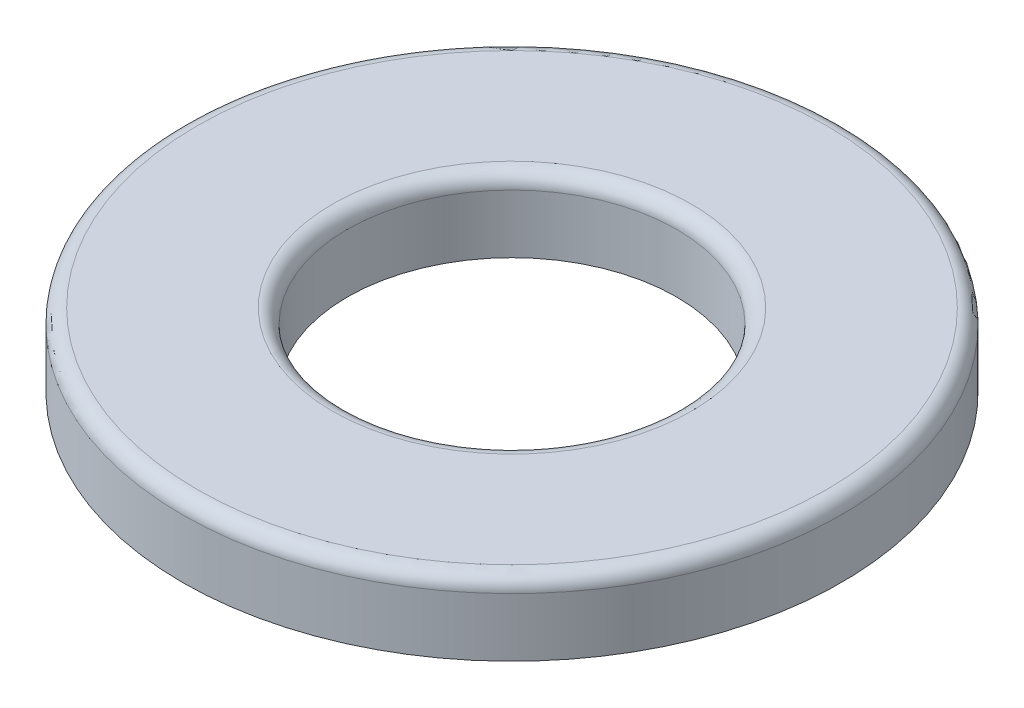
ISO-10303-21;
HEADER;
FILE_DESCRIPTION(('STEP AP214'),'2;1');
FILE_NAME('part.step','',(''),(''),'','','');
FILE_SCHEMA(('AUTOMOTIVE_DESIGN { 1 0 10303 214 1 1 1 1 }'));
ENDSEC;
DATA;
#1=APPLICATION_CONTEXT('core data for automotive mechanical design processes');
#2=APPLICATION_PROTOCOL_DEFINITION('international standard','automotive_design',2000,#1);
#3=PRODUCT_CONTEXT('',#1,'mechanical');
#4=PRODUCT('Part','Part','',(#3));
#5=PRODUCT_RELATED_PRODUCT_CATEGORY('part','',(#4));
#6=PRODUCT_DEFINITION_FORMATION('','',#4);
#7=PRODUCT_DEFINITION_CONTEXT('part definition',#1,'design');
#8=PRODUCT_DEFINITION('design','',#6,#7);
#9=PRODUCT_DEFINITION_SHAPE('','',#8);
#10=(LENGTH_UNIT() NAMED_UNIT(*) SI_UNIT(.MILLI.,.METRE.));
#11=(NAMED_UNIT(*) PLANE_ANGLE_UNIT() SI_UNIT($,.RADIAN.));
#12=(NAMED_UNIT(*) SI_UNIT($,.STERADIAN.) SOLID_ANGLE_UNIT());
#13=UNCERTAINTY_MEASURE_WITH_UNIT(LENGTH_MEASURE(1.E-05),#10,'distance_accuracy_value','');
#14=(GEOMETRIC_REPRESENTATION_CONTEXT(3) GLOBAL_UNCERTAINTY_ASSIGNED_CONTEXT((#13)) GLOBAL_UNIT_ASSIGNED_CONTEXT((#10,
#11,#12)) REPRESENTATION_CONTEXT('',''));
#15=CARTESIAN_POINT('',(0.,0.,0.));
#16=DIRECTION('',(0.,0.,1.));
#17=DIRECTION('',(1.,0.,0.));
#18=AXIS2_PLACEMENT_3D('',#15,#16,#17);
#19=CARTESIAN_POINT('',(0.,0.5,0.));
#20=DIRECTION('',(0.,1.,0.));
#21=DIRECTION('',(0.,0.,1.));
#22=AXIS2_PLACEMENT_3D('',#19,#20,#21);
#23=PLANE('',#22);
#24=CARTESIAN_POINT('',(0.,0.5,0.));
#25=DIRECTION('',(0.,1.,0.));
#26=DIRECTION('',(0.,0.,1.));
#27=AXIS2_PLACEMENT_3D('',#24,#25,#26);
#28=CIRCLE('',#27,4.3);
#29=CARTESIAN_POINT('',(0.,0.5,4.3));
#30=VERTEX_POINT('',#29);
#31=EDGE_CURVE('E46',#30,#30,#28,.T.);
#32=ORIENTED_EDGE('',*,*,#31,.T.);
#33=EDGE_LOOP('',(#32));
#34=FACE_BOUND('',#33,.T.);
#35=CARTESIAN_POINT('',(0.,0.5,0.));
#36=DIRECTION('',(0.,1.,0.));
#37=DIRECTION('',(0.,0.,1.));
#38=AXIS2_PLACEMENT_3D('',#35,#36,#37);
#39=CIRCLE('',#38,2.45);
#40=CARTESIAN_POINT('',(0.,0.5,2.45));
#41=VERTEX_POINT('',#40);
#42=EDGE_CURVE('E50',#41,#41,#39,.F.);
#43=ORIENTED_EDGE('',*,*,#42,.T.);
#44=EDGE_LOOP('',(#43));
#45=FACE_BOUND('',#44,.T.);
#46=ADVANCED_FACE('F35',(#34,#45),#23,.T.);
#47=CARTESIAN_POINT('',(0.,-0.5,0.));
#48=DIRECTION('',(0.,1.,0.));
#49=DIRECTION('',(0.,0.,1.));
#50=AXIS2_PLACEMENT_3D('',#47,#48,#49);
#51=PLANE('',#50);
#52=CARTESIAN_POINT('',(0.,-0.5,0.));
#53=DIRECTION('',(0.,1.,0.));
#54=DIRECTION('',(0.,0.,1.));
#55=AXIS2_PLACEMENT_3D('',#52,#53,#54);
#56=CIRCLE('',#55,4.5);
#57=CARTESIAN_POINT('',(0.,-0.5,4.5));
#58=VERTEX_POINT('',#57);
#59=EDGE_CURVE('E55',#58,#58,#56,.T.);
#60=ORIENTED_EDGE('',*,*,#59,.F.);
#61=EDGE_LOOP('',(#60));
#62=FACE_BOUND('',#61,.T.);
#63=CARTESIAN_POINT('',(0.,-0.5,0.));
#64=DIRECTION('',(0.,1.,0.));
#65=DIRECTION('',(0.,0.,1.));
#66=AXIS2_PLACEMENT_3D('',#63,#64,#65);
#67=CIRCLE('',#66,2.25);
#68=CARTESIAN_POINT('',(0.,-0.5,2.25));
#69=VERTEX_POINT('',#68);
#70=EDGE_CURVE('E58',#69,#69,#67,.T.);
#71=ORIENTED_EDGE('',*,*,#70,.T.);
#72=EDGE_LOOP('',(#71));
#73=FACE_BOUND('',#72,.T.);
#74=ADVANCED_FACE('F62',(#62,#73),#51,.F.);
#75=CARTESIAN_POINT('',(0.,0.5,0.));
#76=DIRECTION('',(0.,-1.,0.));
#77=DIRECTION('',(0.,0.,-1.));
#78=AXIS2_PLACEMENT_3D('',#75,#76,#77);
#79=CYLINDRICAL_SURFACE('',#78,4.5);
#80=CARTESIAN_POINT('',(0.,0.3,0.));
#81=DIRECTION('',(0.,1.,0.));
#82=DIRECTION('',(0.,0.,1.));
#83=AXIS2_PLACEMENT_3D('',#80,#81,#82);
#84=CIRCLE('',#83,4.5);
#85=CARTESIAN_POINT('',(0.,0.3,4.5));
#86=VERTEX_POINT('',#85);
#87=EDGE_CURVE('E42',#86,#86,#84,.F.);
#88=ORIENTED_EDGE('',*,*,#87,.T.);
#89=EDGE_LOOP('',(#88));
#90=FACE_BOUND('',#89,.T.);
#91=ORIENTED_EDGE('',*,*,#59,.T.);
#92=EDGE_LOOP('',(#91));
#93=FACE_BOUND('',#92,.T.);
#94=ADVANCED_FACE('F67',(#90,#93),#79,.T.);
#95=CARTESIAN_POINT('',(0.,0.5,0.));
#96=DIRECTION('',(0.,-1.,0.));
#97=DIRECTION('',(0.,0.,-1.));
#98=AXIS2_PLACEMENT_3D('',#95,#96,#97);
#99=CYLINDRICAL_SURFACE('',#98,2.25);
#100=CARTESIAN_POINT('',(0.,0.3,0.));
#101=DIRECTION('',(0.,1.,0.));
#102=DIRECTION('',(0.,0.,1.));
#103=AXIS2_PLACEMENT_3D('',#100,#101,#102);
#104=CIRCLE('',#103,2.25);
#105=CARTESIAN_POINT('',(0.,0.3,2.25));
#106=VERTEX_POINT('',#105);
#107=EDGE_CURVE('E10',#106,#106,#104,.T.);
#108=ORIENTED_EDGE('',*,*,#107,.T.);
#109=EDGE_LOOP('',(#108));
#110=FACE_BOUND('',#109,.T.);
#111=ORIENTED_EDGE('',*,*,#70,.F.);
#112=EDGE_LOOP('',(#111));
#113=FACE_BOUND('',#112,.T.);
#114=ADVANCED_FACE('F64',(#110,#113),#99,.F.);
#115=CARTESIAN_POINT('',(0.,0.3,0.));
#116=DIRECTION('',(0.,1.,0.));
#117=DIRECTION('',(0.,0.,1.));
#118=AXIS2_PLACEMENT_3D('',#115,#116,#117);
#119=TOROIDAL_SURFACE('',#118,4.3,0.2);
#120=ORIENTED_EDGE('',*,*,#87,.F.);
#121=EDGE_LOOP('',(#120));
#122=FACE_BOUND('',#121,.T.);
#123=ORIENTED_EDGE('',*,*,#31,.F.);
#124=EDGE_LOOP('',(#123));
#125=FACE_BOUND('',#124,.T.);
#126=ADVANCED_FACE('F66',(#122,#125),#119,.T.);
#127=CARTESIAN_POINT('',(0.,0.3,0.));
#128=DIRECTION('',(0.,1.,0.));
#129=DIRECTION('',(0.,0.,1.));
#130=AXIS2_PLACEMENT_3D('',#127,#128,#129);
#131=TOROIDAL_SURFACE('',#130,2.45,0.2);
#132=ORIENTED_EDGE('',*,*,#42,.F.);
#133=EDGE_LOOP('',(#132));
#134=FACE_BOUND('',#133,.T.);
#135=ORIENTED_EDGE('',*,*,#107,.F.);
#136=EDGE_LOOP('',(#135));
#137=FACE_BOUND('',#136,.T.);
#138=ADVANCED_FACE('F37',(#134,#137),#131,.T.);
#139=CLOSED_SHELL('',(#46,#74,#94,#114,#126,#138));
#140=MANIFOLD_SOLID_BREP('B2',#139);
#141=ADVANCED_BREP_SHAPE_REPRESENTATION('',(#18,#140),#14);
#142=SHAPE_DEFINITION_REPRESENTATION(#9,#141);
ENDSEC;
END-ISO-10303-21;
